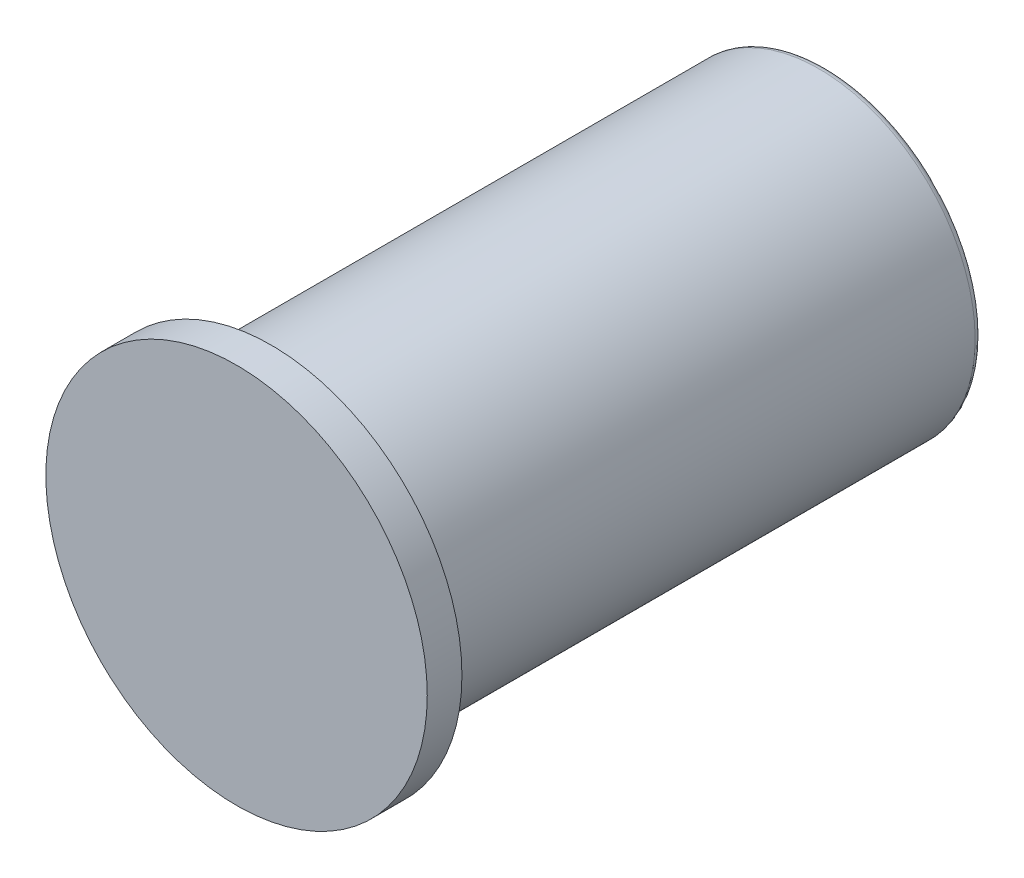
ISO-10303-21;
HEADER;
FILE_DESCRIPTION(('STEP AP214'),'2;1');
FILE_NAME('part.step','',(''),(''),'','','');
FILE_SCHEMA(('AUTOMOTIVE_DESIGN { 1 0 10303 214 1 1 1 1 }'));
ENDSEC;
DATA;
#1=APPLICATION_CONTEXT('core data for automotive mechanical design processes');
#2=APPLICATION_PROTOCOL_DEFINITION('international standard','automotive_design',2000,#1);
#3=PRODUCT_CONTEXT('',#1,'mechanical');
#4=PRODUCT('Part','Part','',(#3));
#5=PRODUCT_RELATED_PRODUCT_CATEGORY('part','',(#4));
#6=PRODUCT_DEFINITION_FORMATION('','',#4);
#7=PRODUCT_DEFINITION_CONTEXT('part definition',#1,'design');
#8=PRODUCT_DEFINITION('design','',#6,#7);
#9=PRODUCT_DEFINITION_SHAPE('','',#8);
#10=(LENGTH_UNIT() NAMED_UNIT(*) SI_UNIT(.MILLI.,.METRE.));
#11=(NAMED_UNIT(*) PLANE_ANGLE_UNIT() SI_UNIT($,.RADIAN.));
#12=(NAMED_UNIT(*) SI_UNIT($,.STERADIAN.) SOLID_ANGLE_UNIT());
#13=UNCERTAINTY_MEASURE_WITH_UNIT(LENGTH_MEASURE(1.E-05),#10,'distance_accuracy_value','');
#14=(GEOMETRIC_REPRESENTATION_CONTEXT(3) GLOBAL_UNCERTAINTY_ASSIGNED_CONTEXT((#13)) GLOBAL_UNIT_ASSIGNED_CONTEXT((#10,
#11,#12)) REPRESENTATION_CONTEXT('',''));
#15=CARTESIAN_POINT('',(0.,0.,0.));
#16=DIRECTION('',(0.,0.,1.));
#17=DIRECTION('',(1.,0.,0.));
#18=AXIS2_PLACEMENT_3D('',#15,#16,#17);
#19=CARTESIAN_POINT('',(0.,0.,-170.));
#20=DIRECTION('',(0.,0.,1.));
#21=DIRECTION('',(1.,0.,0.));
#22=AXIS2_PLACEMENT_3D('',#19,#20,#21);
#23=PLANE('',#22);
#24=CARTESIAN_POINT('',(0.,0.,-170.));
#25=DIRECTION('',(0.,0.,-1.));
#26=DIRECTION('',(-1.,0.,0.));
#27=AXIS2_PLACEMENT_3D('',#24,#25,#26);
#28=CIRCLE('',#27,4.5);
#29=CARTESIAN_POINT('',(-4.5,0.,-170.));
#30=VERTEX_POINT('',#29);
#31=EDGE_CURVE('E66',#30,#30,#28,.T.);
#32=ORIENTED_EDGE('',*,*,#31,.F.);
#33=EDGE_LOOP('',(#32));
#34=FACE_BOUND('',#33,.T.);
#35=CARTESIAN_POINT('',(0.,0.,-170.));
#36=DIRECTION('',(0.,0.,1.));
#37=DIRECTION('',(1.,0.,0.));
#38=AXIS2_PLACEMENT_3D('',#35,#36,#37);
#39=CIRCLE('',#38,43.);
#40=CARTESIAN_POINT('',(43.,0.,-170.));
#41=VERTEX_POINT('',#40);
#42=EDGE_CURVE('E11',#41,#41,#39,.T.);
#43=ORIENTED_EDGE('',*,*,#42,.F.);
#44=EDGE_LOOP('',(#43));
#45=FACE_BOUND('',#44,.T.);
#46=ADVANCED_FACE('F36',(#34,#45),#23,.F.);
#47=CARTESIAN_POINT('',(0.,0.,-168.));
#48=DIRECTION('',(0.,0.,1.));
#49=DIRECTION('',(1.,0.,0.));
#50=AXIS2_PLACEMENT_3D('',#47,#48,#49);
#51=TOROIDAL_SURFACE('',#50,43.,2.);
#52=CARTESIAN_POINT('',(0.,0.,-168.));
#53=DIRECTION('',(0.,0.,1.));
#54=DIRECTION('',(1.,0.,0.));
#55=AXIS2_PLACEMENT_3D('',#52,#53,#54);
#56=CIRCLE('',#55,45.);
#57=CARTESIAN_POINT('',(45.,0.,-168.));
#58=VERTEX_POINT('',#57);
#59=EDGE_CURVE('E43',#58,#58,#56,.T.);
#60=ORIENTED_EDGE('',*,*,#59,.F.);
#61=EDGE_LOOP('',(#60));
#62=FACE_BOUND('',#61,.T.);
#63=ORIENTED_EDGE('',*,*,#42,.T.);
#64=EDGE_LOOP('',(#63));
#65=FACE_BOUND('',#64,.T.);
#66=ADVANCED_FACE('F82',(#62,#65),#51,.T.);
#67=CARTESIAN_POINT('',(0.,0.,0.));
#68=DIRECTION('',(0.,0.,1.));
#69=DIRECTION('',(1.,0.,0.));
#70=AXIS2_PLACEMENT_3D('',#67,#68,#69);
#71=CYLINDRICAL_SURFACE('',#70,45.);
#72=CARTESIAN_POINT('',(0.,0.,-10.));
#73=DIRECTION('',(0.,0.,1.));
#74=DIRECTION('',(1.,0.,0.));
#75=AXIS2_PLACEMENT_3D('',#72,#73,#74);
#76=CIRCLE('',#75,45.);
#77=CARTESIAN_POINT('',(45.,0.,-10.));
#78=VERTEX_POINT('',#77);
#79=EDGE_CURVE('E73',#78,#78,#76,.T.);
#80=ORIENTED_EDGE('',*,*,#79,.F.);
#81=EDGE_LOOP('',(#80));
#82=FACE_BOUND('',#81,.T.);
#83=ORIENTED_EDGE('',*,*,#59,.T.);
#84=EDGE_LOOP('',(#83));
#85=FACE_BOUND('',#84,.T.);
#86=ADVANCED_FACE('F80',(#82,#85),#71,.T.);
#87=CARTESIAN_POINT('',(0.,45.,-10.));
#88=DIRECTION('',(0.,0.,1.));
#89=DIRECTION('',(1.,0.,0.));
#90=AXIS2_PLACEMENT_3D('',#87,#88,#89);
#91=PLANE('',#90);
#92=CARTESIAN_POINT('',(0.,0.,-10.));
#93=DIRECTION('',(0.,0.,1.));
#94=DIRECTION('',(1.,0.,0.));
#95=AXIS2_PLACEMENT_3D('',#92,#93,#94);
#96=CIRCLE('',#95,55.);
#97=CARTESIAN_POINT('',(55.,0.,-10.));
#98=VERTEX_POINT('',#97);
#99=EDGE_CURVE('E63',#98,#98,#96,.T.);
#100=ORIENTED_EDGE('',*,*,#99,.F.);
#101=EDGE_LOOP('',(#100));
#102=FACE_BOUND('',#101,.T.);
#103=ORIENTED_EDGE('',*,*,#79,.T.);
#104=EDGE_LOOP('',(#103));
#105=FACE_BOUND('',#104,.T.);
#106=ADVANCED_FACE('F109',(#102,#105),#91,.F.);
#107=CARTESIAN_POINT('',(0.,0.,0.));
#108=DIRECTION('',(0.,0.,1.));
#109=DIRECTION('',(1.,0.,0.));
#110=AXIS2_PLACEMENT_3D('',#107,#108,#109);
#111=CYLINDRICAL_SURFACE('',#110,55.);
#112=CARTESIAN_POINT('',(0.,0.,0.));
#113=DIRECTION('',(0.,0.,1.));
#114=DIRECTION('',(1.,0.,0.));
#115=AXIS2_PLACEMENT_3D('',#112,#113,#114);
#116=CIRCLE('',#115,55.);
#117=CARTESIAN_POINT('',(55.,0.,0.));
#118=VERTEX_POINT('',#117);
#119=EDGE_CURVE('E57',#118,#118,#116,.T.);
#120=ORIENTED_EDGE('',*,*,#119,.F.);
#121=EDGE_LOOP('',(#120));
#122=FACE_BOUND('',#121,.T.);
#123=ORIENTED_EDGE('',*,*,#99,.T.);
#124=EDGE_LOOP('',(#123));
#125=FACE_BOUND('',#124,.T.);
#126=ADVANCED_FACE('F105',(#122,#125),#111,.T.);
#127=CARTESIAN_POINT('',(0.,55.,0.));
#128=DIRECTION('',(0.,0.,-1.));
#129=DIRECTION('',(-1.,0.,0.));
#130=AXIS2_PLACEMENT_3D('',#127,#128,#129);
#131=PLANE('',#130);
#132=ORIENTED_EDGE('',*,*,#119,.T.);
#133=EDGE_LOOP('',(#132));
#134=FACE_BOUND('',#133,.T.);
#135=ADVANCED_FACE('F50',(#134),#131,.F.);
#136=CARTESIAN_POINT('',(0.,0.,-150.25));
#137=DIRECTION('',(0.,0.,-1.));
#138=DIRECTION('',(-1.,0.,0.));
#139=AXIS2_PLACEMENT_3D('',#136,#137,#138);
#140=CONICAL_SURFACE('',#139,3.39999999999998,1.02974425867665);
#141=CARTESIAN_POINT('',(0.,0.,-148.207073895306));
#142=VERTEX_POINT('',#141);
#143=VERTEX_LOOP('',#142);
#144=FACE_BOUND('',#143,.T.);
#145=CARTESIAN_POINT('',(0.,0.,-150.25));
#146=DIRECTION('',(0.,0.,-1.));
#147=DIRECTION('',(-1.,0.,0.));
#148=AXIS2_PLACEMENT_3D('',#145,#146,#147);
#149=CIRCLE('',#148,3.39999999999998);
#150=CARTESIAN_POINT('',(-3.39999999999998,0.,-150.25));
#151=VERTEX_POINT('',#150);
#152=EDGE_CURVE('E54',#151,#151,#149,.T.);
#153=ORIENTED_EDGE('',*,*,#152,.T.);
#154=EDGE_LOOP('',(#153));
#155=FACE_BOUND('',#154,.T.);
#156=ADVANCED_FACE('F46',(#144,#155),#140,.F.);
#157=CARTESIAN_POINT('',(0.,0.,-170.));
#158=DIRECTION('',(0.,0.,-1.));
#159=DIRECTION('',(-1.,0.,0.));
#160=AXIS2_PLACEMENT_3D('',#157,#158,#159);
#161=CYLINDRICAL_SURFACE('',#160,3.39999999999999);
#162=ORIENTED_EDGE('',*,*,#152,.F.);
#163=EDGE_LOOP('',(#162));
#164=FACE_BOUND('',#163,.T.);
#165=CARTESIAN_POINT('',(0.,0.,-168.9));
#166=DIRECTION('',(0.,0.,-1.));
#167=DIRECTION('',(-1.,0.,0.));
#168=AXIS2_PLACEMENT_3D('',#165,#166,#167);
#169=CIRCLE('',#168,3.4);
#170=CARTESIAN_POINT('',(-3.4,0.,-168.9));
#171=VERTEX_POINT('',#170);
#172=EDGE_CURVE('E58',#171,#171,#169,.T.);
#173=ORIENTED_EDGE('',*,*,#172,.T.);
#174=EDGE_LOOP('',(#173));
#175=FACE_BOUND('',#174,.T.);
#176=ADVANCED_FACE('F49',(#164,#175),#161,.F.);
#177=CARTESIAN_POINT('',(0.,0.,-170.));
#178=DIRECTION('',(0.,0.,-1.));
#179=DIRECTION('',(-1.,0.,0.));
#180=AXIS2_PLACEMENT_3D('',#177,#178,#179);
#181=CONICAL_SURFACE('',#180,4.5,0.785398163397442);
#182=ORIENTED_EDGE('',*,*,#172,.F.);
#183=EDGE_LOOP('',(#182));
#184=FACE_BOUND('',#183,.T.);
#185=ORIENTED_EDGE('',*,*,#31,.T.);
#186=EDGE_LOOP('',(#185));
#187=FACE_BOUND('',#186,.T.);
#188=ADVANCED_FACE('F94',(#184,#187),#181,.F.);
#189=CLOSED_SHELL('',(#46,#66,#86,#106,#126,#135,#156,#176,#188));
#190=MANIFOLD_SOLID_BREP('B2',#189);
#191=ADVANCED_BREP_SHAPE_REPRESENTATION('',(#18,#190),#14);
#192=SHAPE_DEFINITION_REPRESENTATION(#9,#191);
ENDSEC;
END-ISO-10303-21;
